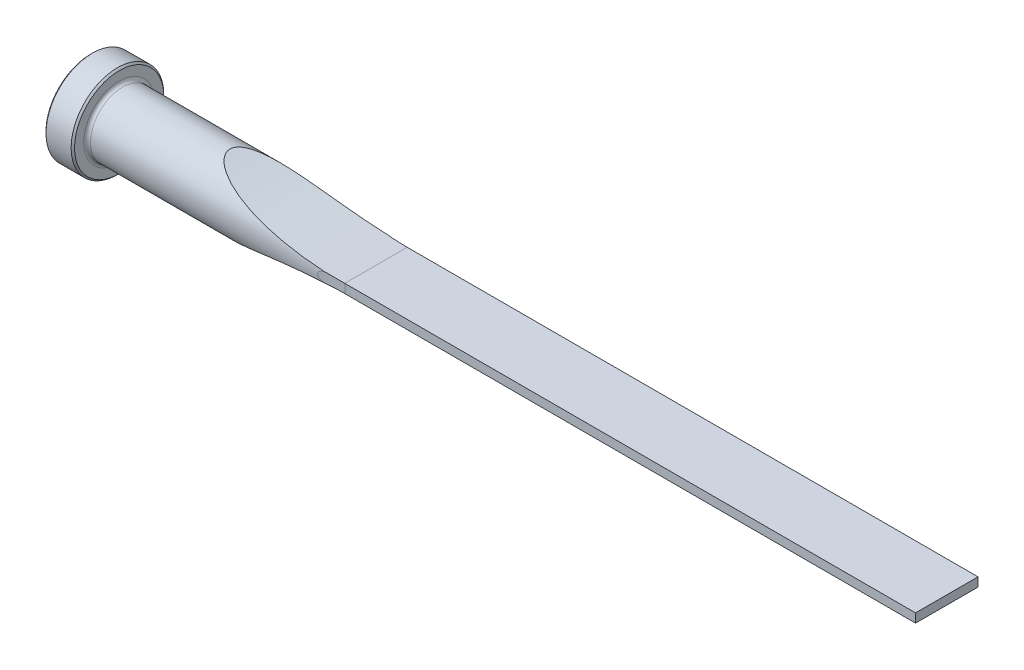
from build123d import *

# Parameters (mm, degrees)
CUT_EXTRUDE1_DEPTH = 192.05742903
CUT_EXTRUDE2_DEPTH = 192.05742913
FILLET1_R          = 0.762
CHAMFER1_SIZE      = 0.381


with BuildPart() as part:
    # Sketch1 → Revolve1 (revolve)
    with BuildSketch(Plane.XY, mode=Mode.PRIVATE) as revolve1_sk:
        Polygon((0, 0), (0, 10.3124), (6.35, 10.3124), (6.35, 7.14375), (190.5, 7.14375), (190.5, 0), align=None)
    revolve(revolve1_sk.sketch.rotate(Axis((0, 0, 0), (1, 0, 0)), 90), axis=Axis((0, 0, 0), (1, 0, 0)))

    # Sketch2 → Cut-Extrude1 (cut, symmetric)
    with BuildSketch(Plane.XY):
        with BuildLine():
            Line((190.5, 7.14375), (190.5, 0.9906))
            Line((190.5, 0.9906), (63.5, 0.9906))
            ThreePointArc((63.5, 0.9906), (46.961937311, 2.542431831), (31.001249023, 7.14375))
            Line((31.001249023, 7.14375), (190.5, 7.14375))
        make_face()
    cut_extrude1 = extrude(amount=CUT_EXTRUDE1_DEPTH, both=True, mode=Mode.SUBTRACT)

    # Mirror1: Cut-Extrude1 across plane
    add(cut_extrude1.mirror(Plane.ZX), mode=Mode.SUBTRACT)

    # Sketch3 → Cut-Extrude2 (cut, symmetric)
    with BuildSketch(Plane(origin=(0, 0, 0), x_dir=(1, 0, 0), z_dir=(0, 1, 0))):
        with BuildLine():
            Line((190.5, 7.14375), (190.5, 6.9469))
            Line((190.5, 6.9469), (63.5, 6.9469))
            ThreePointArc((63.5, 6.9469), (60.541963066, 6.996126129), (57.587202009, 7.14375))
            Line((57.587202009, 7.14375), (190.5, 7.14375))
        make_face()
    cut_extrude2 = extrude(amount=CUT_EXTRUDE2_DEPTH, both=True, mode=Mode.SUBTRACT)

    # Mirror2: Cut-Extrude2 across plane
    add(cut_extrude2.mirror(Plane.XY), mode=Mode.SUBTRACT)

    # Fillet1
    fillet1_edges = [part.edges().sort_by_distance(p)[0] for p in [
        (6.35, 0, -7.14375),
    ]]
    fillet(fillet1_edges, radius=FILLET1_R)

    # Chamfer1
    chamfer1_edges = [part.edges().sort_by_distance(p)[0] for p in [
        (6.35, 0, -10.3124),
        (0, 0, -10.3124),
    ]]
    chamfer(chamfer1_edges, length=CHAMFER1_SIZE)


solid = part.part
